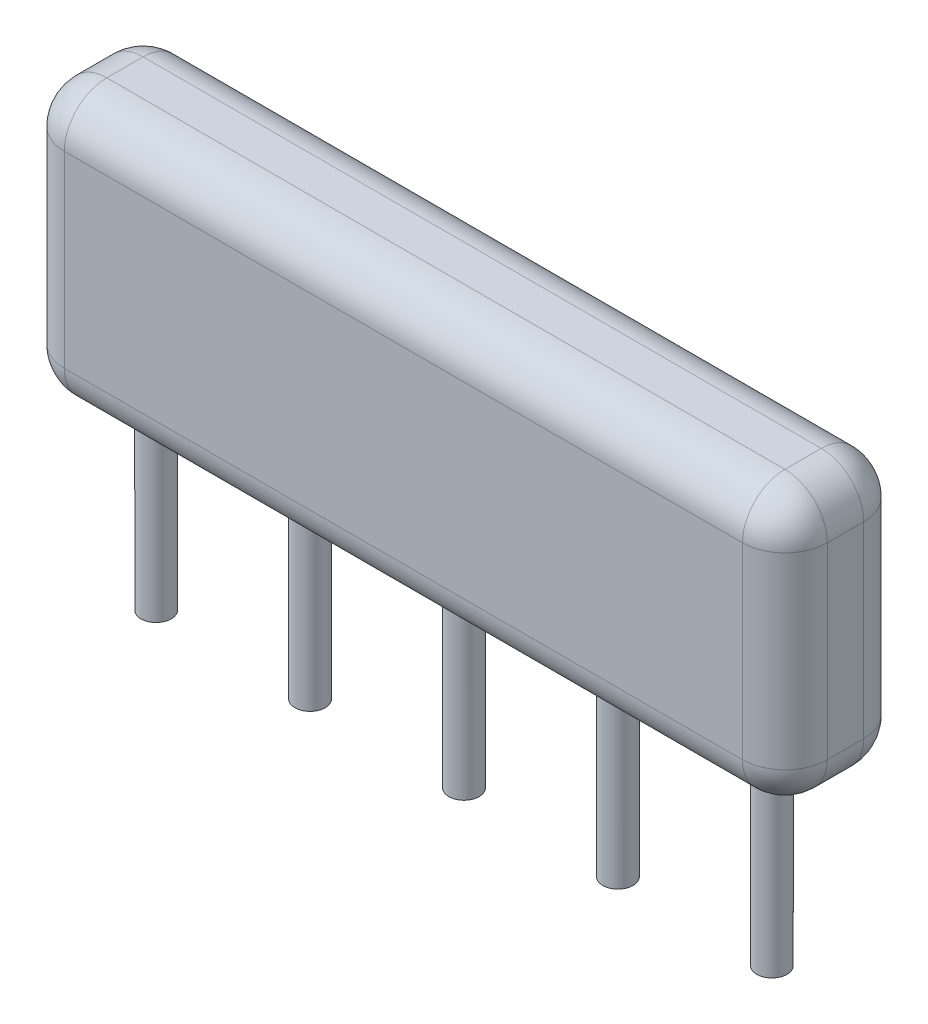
from build123d import *

# Parameters (mm, degrees)
ESQUISSE1_W      = 12.59
ESQUISSE1_H      = 4.5
EXTRUSION1_DEPTH = 2
ESQUISSE2_R      = 0.25
EXTRUSION2_DEPTH = 3
CONG_1_R         = 0.7


with BuildPart() as part:
    # Esquisse1 → Extrusion1 (new body)
    with BuildSketch(Plane.XY):
        with Locations((6.295, 2.25)):
            Rectangle(ESQUISSE1_W, ESQUISSE1_H)
    extrude(amount=EXTRUSION1_DEPTH)

    # Esquisse2 → Extrusion2 (add)
    with BuildSketch(Plane.XZ):
        with Locations(Location((1.215, 1, 0), (0, 0, 90))):
            Circle(ESQUISSE2_R)
        with Locations(Location((3.755, 1, 0), (0, 0, 90))):
            Circle(ESQUISSE2_R)
        with Locations(Location((6.295, 1, 0), (0, 0, 90))):
            Circle(ESQUISSE2_R)
        with Locations(Location((8.835, 1, 0), (0, 0, 90))):
            Circle(ESQUISSE2_R)
        with Locations(Location((11.375, 1, 0), (0, 0, 90))):
            Circle(ESQUISSE2_R)
    extrude(amount=EXTRUSION2_DEPTH)

    # Cong_1
    cong_1_edges = [part.edges().sort_by_distance(p)[0] for p in [
        (12.59, 2.25, 2),
        (6.295, 4.5, 2),
        (0, 2.25, 2),
        (6.295, 4.5, 0),
        (12.59, 2.25, 0),
        (6.295, 0, 0),
        (0, 2.25, 0),
        (6.295, 0, 2),
        (0, 4.5, 1),
        (12.59, 4.5, 1),
        (12.59, 0, 1),
        (0, 0, 1),
    ]]
    fillet(cong_1_edges, radius=CONG_1_R)


solid = part.part
